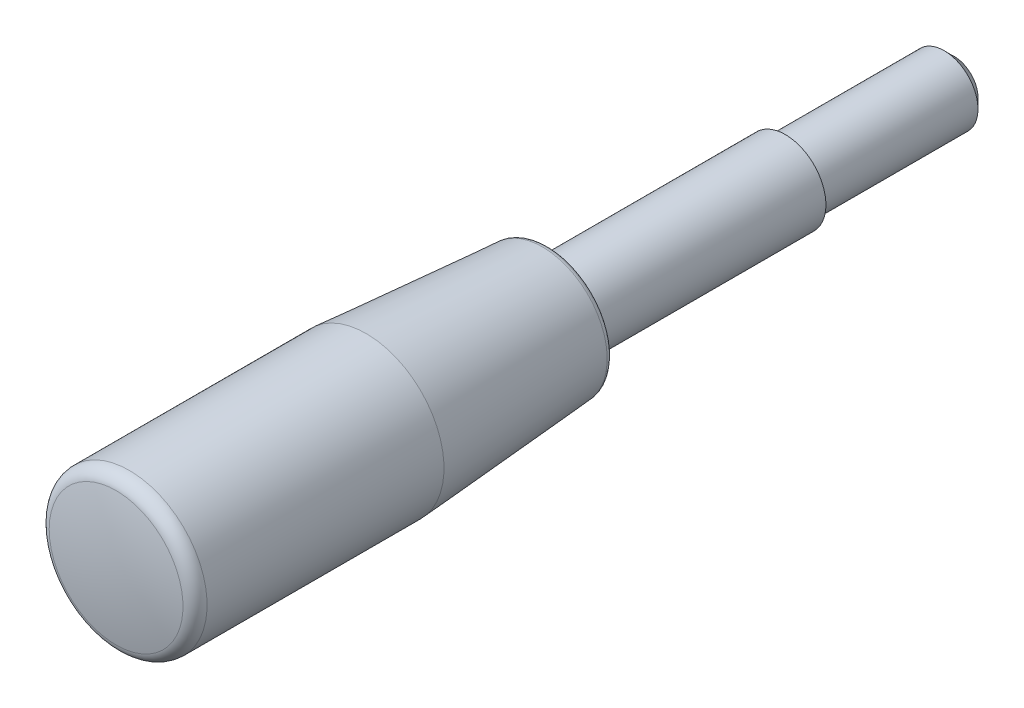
ISO-10303-21;
HEADER;
FILE_DESCRIPTION(('STEP AP214'),'2;1');
FILE_NAME('part.step','',(''),(''),'','','');
FILE_SCHEMA(('AUTOMOTIVE_DESIGN { 1 0 10303 214 1 1 1 1 }'));
ENDSEC;
DATA;
#1=APPLICATION_CONTEXT('core data for automotive mechanical design processes');
#2=APPLICATION_PROTOCOL_DEFINITION('international standard','automotive_design',2000,#1);
#3=PRODUCT_CONTEXT('',#1,'mechanical');
#4=PRODUCT('Part','Part','',(#3));
#5=PRODUCT_RELATED_PRODUCT_CATEGORY('part','',(#4));
#6=PRODUCT_DEFINITION_FORMATION('','',#4);
#7=PRODUCT_DEFINITION_CONTEXT('part definition',#1,'design');
#8=PRODUCT_DEFINITION('design','',#6,#7);
#9=PRODUCT_DEFINITION_SHAPE('','',#8);
#10=(LENGTH_UNIT() NAMED_UNIT(*) SI_UNIT(.MILLI.,.METRE.));
#11=(NAMED_UNIT(*) PLANE_ANGLE_UNIT() SI_UNIT($,.RADIAN.));
#12=(NAMED_UNIT(*) SI_UNIT($,.STERADIAN.) SOLID_ANGLE_UNIT());
#13=UNCERTAINTY_MEASURE_WITH_UNIT(LENGTH_MEASURE(1.E-05),#10,'distance_accuracy_value','');
#14=(GEOMETRIC_REPRESENTATION_CONTEXT(3) GLOBAL_UNCERTAINTY_ASSIGNED_CONTEXT((#13)) GLOBAL_UNIT_ASSIGNED_CONTEXT((#10,
#11,#12)) REPRESENTATION_CONTEXT('',''));
#15=CARTESIAN_POINT('',(0.,0.,0.));
#16=DIRECTION('',(0.,0.,1.));
#17=DIRECTION('',(1.,0.,0.));
#18=AXIS2_PLACEMENT_3D('',#15,#16,#17);
#19=CARTESIAN_POINT('',(0.,0.,-36.7238033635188));
#20=DIRECTION('',(0.,0.,-1.));
#21=DIRECTION('',(-1.,0.,0.));
#22=AXIS2_PLACEMENT_3D('',#19,#20,#21);
#23=CYLINDRICAL_SURFACE('',#22,5.);
#24=CARTESIAN_POINT('',(0.,0.,-23.5));
#25=DIRECTION('',(0.,0.,-1.));
#26=DIRECTION('',(-1.,0.,0.));
#27=AXIS2_PLACEMENT_3D('',#24,#25,#26);
#28=CIRCLE('',#27,5.);
#29=CARTESIAN_POINT('',(-5.,0.,-23.5));
#30=VERTEX_POINT('',#29);
#31=EDGE_CURVE('E8',#30,#30,#28,.T.);
#32=ORIENTED_EDGE('',*,*,#31,.F.);
#33=EDGE_LOOP('',(#32));
#34=FACE_BOUND('',#33,.T.);
#35=CARTESIAN_POINT('',(0.,0.,0.));
#36=DIRECTION('',(0.,0.,-1.));
#37=DIRECTION('',(-1.,0.,0.));
#38=AXIS2_PLACEMENT_3D('',#35,#36,#37);
#39=CIRCLE('',#38,5.);
#40=CARTESIAN_POINT('',(-5.,0.,0.));
#41=VERTEX_POINT('',#40);
#42=EDGE_CURVE('E46',#41,#41,#39,.T.);
#43=ORIENTED_EDGE('',*,*,#42,.T.);
#44=EDGE_LOOP('',(#43));
#45=FACE_BOUND('',#44,.T.);
#46=ADVANCED_FACE('F12',(#34,#45),#23,.T.);
#47=CARTESIAN_POINT('',(0.,0.,-23.5));
#48=DIRECTION('',(0.,0.,1.));
#49=DIRECTION('',(1.,0.,0.));
#50=AXIS2_PLACEMENT_3D('',#47,#48,#49);
#51=CONICAL_SURFACE('',#50,5.,0.785398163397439);
#52=CARTESIAN_POINT('',(0.,0.,-25.));
#53=DIRECTION('',(0.,0.,-1.));
#54=DIRECTION('',(-1.,0.,0.));
#55=AXIS2_PLACEMENT_3D('',#52,#53,#54);
#56=CIRCLE('',#55,3.5);
#57=CARTESIAN_POINT('',(-3.5,0.,-25.));
#58=VERTEX_POINT('',#57);
#59=EDGE_CURVE('E18',#58,#58,#56,.T.);
#60=ORIENTED_EDGE('',*,*,#59,.F.);
#61=EDGE_LOOP('',(#60));
#62=FACE_BOUND('',#61,.T.);
#63=ORIENTED_EDGE('',*,*,#31,.T.);
#64=EDGE_LOOP('',(#63));
#65=FACE_BOUND('',#64,.T.);
#66=ADVANCED_FACE('F102',(#62,#65),#51,.T.);
#67=CARTESIAN_POINT('',(0.,3.5,-25.));
#68=DIRECTION('',(0.,0.,1.));
#69=DIRECTION('',(1.,0.,0.));
#70=AXIS2_PLACEMENT_3D('',#67,#68,#69);
#71=PLANE('',#70);
#72=ORIENTED_EDGE('',*,*,#59,.T.);
#73=EDGE_LOOP('',(#72));
#74=FACE_BOUND('',#73,.T.);
#75=ADVANCED_FACE('F95',(#74),#71,.F.);
#76=CARTESIAN_POINT('',(0.,0.,50.));
#77=DIRECTION('',(-1.,0.,0.));
#78=DIRECTION('',(0.,0.,1.));
#79=AXIS2_PLACEMENT_3D('',#76,#77,#78);
#80=SPHERICAL_SURFACE('',#79,50.);
#81=CARTESIAN_POINT('',(0.,0.,50.));
#82=DIRECTION('',(0.,0.,-1.));
#83=DIRECTION('',(-1.,0.,0.));
#84=AXIS2_PLACEMENT_3D('',#81,#82,#83);
#85=SPHERICAL_SURFACE('',#84,50.);
#86=CARTESIAN_POINT('',(0.,0.,99.010942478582));
#87=DIRECTION('',(0.,0.,-1.));
#88=DIRECTION('',(-1.,0.,0.));
#89=AXIS2_PLACEMENT_3D('',#86,#87,#88);
#90=CIRCLE('',#89,9.8958333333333);
#91=CARTESIAN_POINT('',(-9.8958333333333,0.,99.010942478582));
#92=VERTEX_POINT('',#91);
#93=EDGE_CURVE('E22',#92,#92,#90,.T.);
#94=ORIENTED_EDGE('',*,*,#93,.F.);
#95=EDGE_LOOP('',(#94));
#96=FACE_BOUND('',#95,.T.);
#97=ADVANCED_FACE('F90',(#96),#85,.T.);
#98=CARTESIAN_POINT('',(0.,0.,97.050504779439));
#99=DIRECTION('',(0.,0.,-1.));
#100=DIRECTION('',(-1.,0.,0.));
#101=AXIS2_PLACEMENT_3D('',#98,#99,#100);
#102=TOROIDAL_SURFACE('',#101,9.5,2.);
#103=CARTESIAN_POINT('',(0.,0.,97.050504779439));
#104=DIRECTION('',(0.,0.,-1.));
#105=DIRECTION('',(-1.,0.,0.));
#106=AXIS2_PLACEMENT_3D('',#103,#104,#105);
#107=CIRCLE('',#106,11.5);
#108=CARTESIAN_POINT('',(-11.5,0.,97.050504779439));
#109=VERTEX_POINT('',#108);
#110=EDGE_CURVE('E26',#109,#109,#107,.T.);
#111=ORIENTED_EDGE('',*,*,#110,.F.);
#112=EDGE_LOOP('',(#111));
#113=FACE_BOUND('',#112,.T.);
#114=ORIENTED_EDGE('',*,*,#93,.T.);
#115=EDGE_LOOP('',(#114));
#116=FACE_BOUND('',#115,.T.);
#117=ADVANCED_FACE('F84',(#113,#116),#102,.T.);
#118=CARTESIAN_POINT('',(0.,0.,-36.7238033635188));
#119=DIRECTION('',(0.,0.,-1.));
#120=DIRECTION('',(-1.,0.,0.));
#121=AXIS2_PLACEMENT_3D('',#118,#119,#120);
#122=CYLINDRICAL_SURFACE('',#121,11.5);
#123=CARTESIAN_POINT('',(0.,0.,62.));
#124=DIRECTION('',(0.,0.,-1.));
#125=DIRECTION('',(-1.,0.,0.));
#126=AXIS2_PLACEMENT_3D('',#123,#124,#125);
#127=CIRCLE('',#126,11.5);
#128=CARTESIAN_POINT('',(-11.5,0.,62.));
#129=VERTEX_POINT('',#128);
#130=EDGE_CURVE('E31',#129,#129,#127,.T.);
#131=ORIENTED_EDGE('',*,*,#130,.F.);
#132=EDGE_LOOP('',(#131));
#133=FACE_BOUND('',#132,.T.);
#134=ORIENTED_EDGE('',*,*,#110,.T.);
#135=EDGE_LOOP('',(#134));
#136=FACE_BOUND('',#135,.T.);
#137=ADVANCED_FACE('F78',(#133,#136),#122,.T.);
#138=CARTESIAN_POINT('',(0.,0.,62.));
#139=DIRECTION('',(0.,0.,1.));
#140=DIRECTION('',(1.,0.,0.));
#141=AXIS2_PLACEMENT_3D('',#138,#139,#140);
#142=CONICAL_SURFACE('',#141,11.5,0.0739390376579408);
#143=CARTESIAN_POINT('',(0.,0.,35.9261283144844));
#144=DIRECTION('',(0.,0.,-1.));
#145=DIRECTION('',(-1.,0.,0.));
#146=AXIS2_PLACEMENT_3D('',#143,#144,#145);
#147=CIRCLE('',#146,9.56860209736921);
#148=CARTESIAN_POINT('',(-9.56860209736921,0.,35.9261283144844));
#149=VERTEX_POINT('',#148);
#150=EDGE_CURVE('E34',#149,#149,#147,.T.);
#151=ORIENTED_EDGE('',*,*,#150,.F.);
#152=EDGE_LOOP('',(#151));
#153=FACE_BOUND('',#152,.T.);
#154=ORIENTED_EDGE('',*,*,#130,.T.);
#155=EDGE_LOOP('',(#154));
#156=FACE_BOUND('',#155,.T.);
#157=ADVANCED_FACE('F72',(#153,#156),#142,.T.);
#158=CARTESIAN_POINT('',(0.,0.,36.));
#159=DIRECTION('',(0.,0.,-1.));
#160=DIRECTION('',(-1.,0.,0.));
#161=AXIS2_PLACEMENT_3D('',#158,#159,#160);
#162=TOROIDAL_SURFACE('',#161,8.57133434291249,1.00000000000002);
#163=CARTESIAN_POINT('',(0.,0.,35.));
#164=DIRECTION('',(0.,0.,-1.));
#165=DIRECTION('',(-1.,0.,0.));
#166=AXIS2_PLACEMENT_3D('',#163,#164,#165);
#167=CIRCLE('',#166,8.57133434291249);
#168=CARTESIAN_POINT('',(-8.57133434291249,0.,35.));
#169=VERTEX_POINT('',#168);
#170=EDGE_CURVE('E37',#169,#169,#167,.T.);
#171=ORIENTED_EDGE('',*,*,#170,.F.);
#172=EDGE_LOOP('',(#171));
#173=FACE_BOUND('',#172,.T.);
#174=ORIENTED_EDGE('',*,*,#150,.T.);
#175=EDGE_LOOP('',(#174));
#176=FACE_BOUND('',#175,.T.);
#177=ADVANCED_FACE('F66',(#173,#176),#162,.T.);
#178=CARTESIAN_POINT('',(0.,8.57133434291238,35.));
#179=DIRECTION('',(0.,0.,1.));
#180=DIRECTION('',(1.,0.,0.));
#181=AXIS2_PLACEMENT_3D('',#178,#179,#180);
#182=PLANE('',#181);
#183=CARTESIAN_POINT('',(0.,0.,35.));
#184=DIRECTION('',(0.,0.,-1.));
#185=DIRECTION('',(-1.,0.,0.));
#186=AXIS2_PLACEMENT_3D('',#183,#184,#185);
#187=CIRCLE('',#186,6.);
#188=CARTESIAN_POINT('',(-6.,0.,35.));
#189=VERTEX_POINT('',#188);
#190=EDGE_CURVE('E40',#189,#189,#187,.T.);
#191=ORIENTED_EDGE('',*,*,#190,.F.);
#192=EDGE_LOOP('',(#191));
#193=FACE_BOUND('',#192,.T.);
#194=ORIENTED_EDGE('',*,*,#170,.T.);
#195=EDGE_LOOP('',(#194));
#196=FACE_BOUND('',#195,.T.);
#197=ADVANCED_FACE('F60',(#193,#196),#182,.F.);
#198=CARTESIAN_POINT('',(0.,0.,-36.7238033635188));
#199=DIRECTION('',(0.,0.,-1.));
#200=DIRECTION('',(-1.,0.,0.));
#201=AXIS2_PLACEMENT_3D('',#198,#199,#200);
#202=CYLINDRICAL_SURFACE('',#201,6.);
#203=CARTESIAN_POINT('',(0.,0.,0.));
#204=DIRECTION('',(0.,0.,-1.));
#205=DIRECTION('',(-1.,0.,0.));
#206=AXIS2_PLACEMENT_3D('',#203,#204,#205);
#207=CIRCLE('',#206,6.);
#208=CARTESIAN_POINT('',(-6.,0.,0.));
#209=VERTEX_POINT('',#208);
#210=EDGE_CURVE('E43',#209,#209,#207,.T.);
#211=ORIENTED_EDGE('',*,*,#210,.F.);
#212=EDGE_LOOP('',(#211));
#213=FACE_BOUND('',#212,.T.);
#214=ORIENTED_EDGE('',*,*,#190,.T.);
#215=EDGE_LOOP('',(#214));
#216=FACE_BOUND('',#215,.T.);
#217=ADVANCED_FACE('F54',(#213,#216),#202,.T.);
#218=CARTESIAN_POINT('',(0.,6.,0.));
#219=DIRECTION('',(0.,0.,1.));
#220=DIRECTION('',(1.,0.,0.));
#221=AXIS2_PLACEMENT_3D('',#218,#219,#220);
#222=PLANE('',#221);
#223=ORIENTED_EDGE('',*,*,#42,.F.);
#224=EDGE_LOOP('',(#223));
#225=FACE_BOUND('',#224,.T.);
#226=ORIENTED_EDGE('',*,*,#210,.T.);
#227=EDGE_LOOP('',(#226));
#228=FACE_BOUND('',#227,.T.);
#229=ADVANCED_FACE('F51',(#225,#228),#222,.F.);
#230=CLOSED_SHELL('',(#46,#66,#75,#97,#117,#137,#157,#177,#197,#217,#229));
#231=MANIFOLD_SOLID_BREP('B1',#230);
#232=ADVANCED_BREP_SHAPE_REPRESENTATION('',(#18,#231),#14);
#233=SHAPE_DEFINITION_REPRESENTATION(#9,#232);
ENDSEC;
END-ISO-10303-21;
